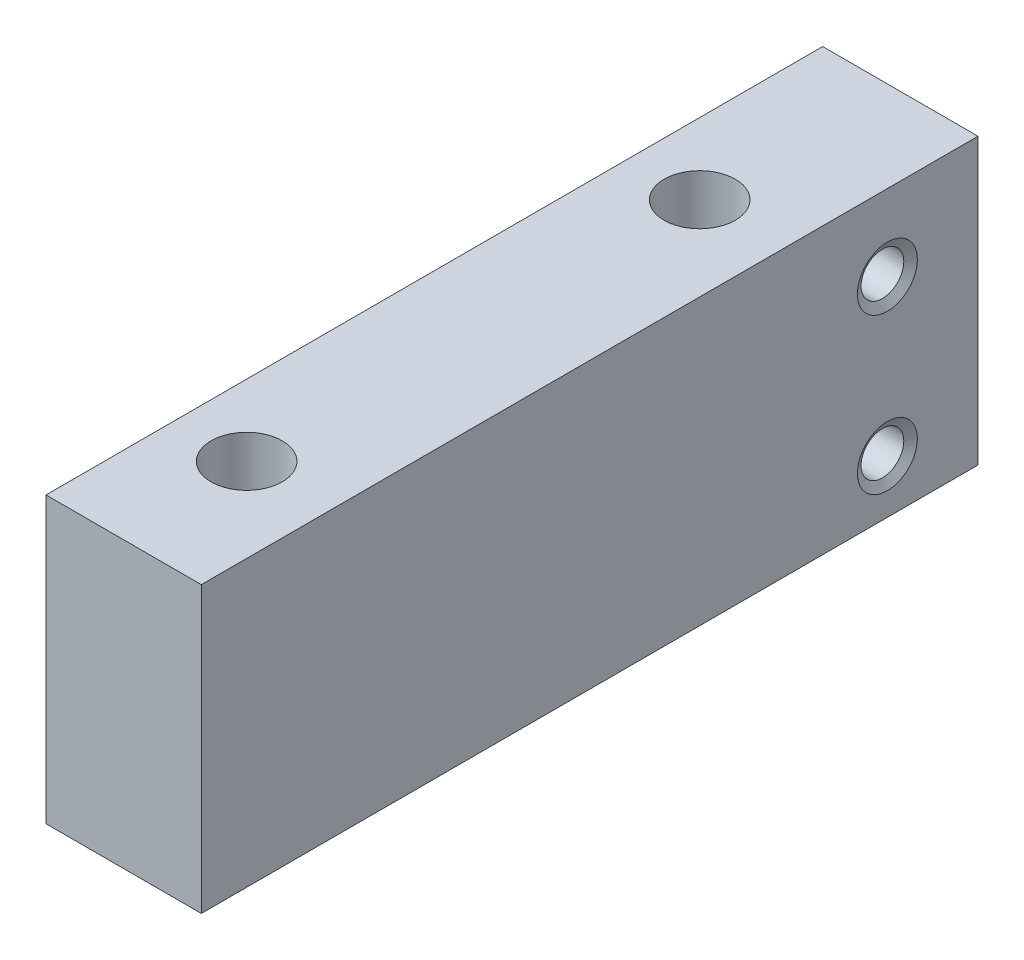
ISO-10303-21;
HEADER;
FILE_DESCRIPTION(('STEP AP214'),'2;1');
FILE_NAME('part.step','',(''),(''),'','','');
FILE_SCHEMA(('AUTOMOTIVE_DESIGN { 1 0 10303 214 1 1 1 1 }'));
ENDSEC;
DATA;
#1=APPLICATION_CONTEXT('core data for automotive mechanical design processes');
#2=APPLICATION_PROTOCOL_DEFINITION('international standard','automotive_design',2000,#1);
#3=PRODUCT_CONTEXT('',#1,'mechanical');
#4=PRODUCT('Part','Part','',(#3));
#5=PRODUCT_RELATED_PRODUCT_CATEGORY('part','',(#4));
#6=PRODUCT_DEFINITION_FORMATION('','',#4);
#7=PRODUCT_DEFINITION_CONTEXT('part definition',#1,'design');
#8=PRODUCT_DEFINITION('design','',#6,#7);
#9=PRODUCT_DEFINITION_SHAPE('','',#8);
#10=(LENGTH_UNIT() NAMED_UNIT(*) SI_UNIT(.MILLI.,.METRE.));
#11=(NAMED_UNIT(*) PLANE_ANGLE_UNIT() SI_UNIT($,.RADIAN.));
#12=(NAMED_UNIT(*) SI_UNIT($,.STERADIAN.) SOLID_ANGLE_UNIT());
#13=UNCERTAINTY_MEASURE_WITH_UNIT(LENGTH_MEASURE(1.E-05),#10,'distance_accuracy_value','');
#14=(GEOMETRIC_REPRESENTATION_CONTEXT(3) GLOBAL_UNCERTAINTY_ASSIGNED_CONTEXT((#13)) GLOBAL_UNIT_ASSIGNED_CONTEXT((#10,
#11,#12)) REPRESENTATION_CONTEXT('',''));
#15=CARTESIAN_POINT('',(0.,0.,0.));
#16=DIRECTION('',(0.,0.,1.));
#17=DIRECTION('',(1.,0.,0.));
#18=AXIS2_PLACEMENT_3D('',#15,#16,#17);
#19=CARTESIAN_POINT('',(6.5,0.,21.));
#20=DIRECTION('',(0.,-1.,0.));
#21=DIRECTION('',(0.,0.,-1.));
#22=AXIS2_PLACEMENT_3D('',#19,#20,#21);
#23=PLANE('',#22);
#24=CARTESIAN_POINT('',(6.5,0.,21.));
#25=DIRECTION('',(0.,-1.,0.));
#26=DIRECTION('',(0.,0.,-1.));
#27=AXIS2_PLACEMENT_3D('',#24,#25,#26);
#28=CIRCLE('',#27,2.75);
#29=CARTESIAN_POINT('',(6.5,0.,18.25));
#30=VERTEX_POINT('',#29);
#31=EDGE_CURVE('E118',#30,#30,#28,.F.);
#32=ORIENTED_EDGE('',*,*,#31,.T.);
#33=EDGE_LOOP('',(#32));
#34=FACE_BOUND('',#33,.T.);
#35=CARTESIAN_POINT('',(6.5,0.,21.));
#36=DIRECTION('',(0.,-1.,0.));
#37=DIRECTION('',(0.,0.,-1.));
#38=AXIS2_PLACEMENT_3D('',#35,#36,#37);
#39=CIRCLE('',#38,4.5);
#40=CARTESIAN_POINT('',(6.5,0.,16.5));
#41=VERTEX_POINT('',#40);
#42=EDGE_CURVE('E120',#41,#41,#39,.T.);
#43=ORIENTED_EDGE('',*,*,#42,.T.);
#44=EDGE_LOOP('',(#43));
#45=FACE_BOUND('',#44,.T.);
#46=ADVANCED_FACE('F16',(#34,#45),#23,.T.);
#47=CARTESIAN_POINT('',(6.5,0.,-13.9999999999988));
#48=DIRECTION('',(0.,-1.,0.));
#49=DIRECTION('',(0.,0.,-1.));
#50=AXIS2_PLACEMENT_3D('',#47,#48,#49);
#51=PLANE('',#50);
#52=CARTESIAN_POINT('',(6.5,0.,-13.9999999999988));
#53=DIRECTION('',(0.,-1.,0.));
#54=DIRECTION('',(0.,0.,-1.));
#55=AXIS2_PLACEMENT_3D('',#52,#53,#54);
#56=CIRCLE('',#55,2.75);
#57=CARTESIAN_POINT('',(6.5,0.,-16.7499999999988));
#58=VERTEX_POINT('',#57);
#59=EDGE_CURVE('E115',#58,#58,#56,.F.);
#60=ORIENTED_EDGE('',*,*,#59,.T.);
#61=EDGE_LOOP('',(#60));
#62=FACE_BOUND('',#61,.T.);
#63=CARTESIAN_POINT('',(6.5,0.,-13.9999999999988));
#64=DIRECTION('',(0.,-1.,0.));
#65=DIRECTION('',(0.,0.,-1.));
#66=AXIS2_PLACEMENT_3D('',#63,#64,#65);
#67=CIRCLE('',#66,4.5);
#68=CARTESIAN_POINT('',(6.5,0.,-18.4999999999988));
#69=VERTEX_POINT('',#68);
#70=EDGE_CURVE('E19',#69,#69,#67,.T.);
#71=ORIENTED_EDGE('',*,*,#70,.T.);
#72=EDGE_LOOP('',(#71));
#73=FACE_BOUND('',#72,.T.);
#74=ADVANCED_FACE('F157',(#62,#73),#51,.T.);
#75=CARTESIAN_POINT('',(12.9999999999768,11.1,-21.9999999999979));
#76=DIRECTION('',(1.,0.,0.));
#77=DIRECTION('',(0.,0.,-1.));
#78=AXIS2_PLACEMENT_3D('',#75,#76,#77);
#79=CONICAL_SURFACE('',#78,2.31499999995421,1.04719755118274);
#80=CARTESIAN_POINT('',(12.9999999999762,11.1,-21.9999999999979));
#81=DIRECTION('',(1.,0.,0.));
#82=DIRECTION('',(0.,0.,-1.));
#83=AXIS2_PLACEMENT_3D('',#80,#81,#82);
#84=CIRCLE('',#83,2.31499999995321);
#85=CARTESIAN_POINT('',(12.9999999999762,11.1,-24.3149999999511));
#86=VERTEX_POINT('',#85);
#87=EDGE_CURVE('E103',#86,#86,#84,.T.);
#88=ORIENTED_EDGE('',*,*,#87,.T.);
#89=EDGE_LOOP('',(#88));
#90=FACE_BOUND('',#89,.T.);
#91=CARTESIAN_POINT('',(12.6160620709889,11.1,-21.9999999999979));
#92=DIRECTION('',(1.,0.,0.));
#93=DIRECTION('',(0.,0.,-1.));
#94=AXIS2_PLACEMENT_3D('',#91,#92,#93);
#95=CIRCLE('',#94,1.65);
#96=CARTESIAN_POINT('',(12.6160620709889,11.1,-23.6499999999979));
#97=VERTEX_POINT('',#96);
#98=EDGE_CURVE('E100',#97,#97,#95,.F.);
#99=ORIENTED_EDGE('',*,*,#98,.T.);
#100=EDGE_LOOP('',(#99));
#101=FACE_BOUND('',#100,.T.);
#102=ADVANCED_FACE('F163',(#90,#101),#79,.F.);
#103=CARTESIAN_POINT('',(12.9999999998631,-0.899999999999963,-21.9999999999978));
#104=DIRECTION('',(1.,0.,0.));
#105=DIRECTION('',(0.,0.,-1.));
#106=AXIS2_PLACEMENT_3D('',#103,#104,#105);
#107=CONICAL_SURFACE('',#106,2.31499999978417,1.04719755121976);
#108=CARTESIAN_POINT('',(12.9999999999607,-0.899999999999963,-21.9999999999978));
#109=DIRECTION('',(1.,0.,0.));
#110=DIRECTION('',(0.,0.,-1.));
#111=AXIS2_PLACEMENT_3D('',#108,#109,#110);
#112=CIRCLE('',#111,2.31499999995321);
#113=CARTESIAN_POINT('',(12.9999999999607,-0.899999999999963,-24.314999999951));
#114=VERTEX_POINT('',#113);
#115=EDGE_CURVE('E112',#114,#114,#112,.T.);
#116=ORIENTED_EDGE('',*,*,#115,.T.);
#117=EDGE_LOOP('',(#116));
#118=FACE_BOUND('',#117,.T.);
#119=CARTESIAN_POINT('',(12.6160620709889,-0.899999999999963,-21.9999999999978));
#120=DIRECTION('',(1.,0.,0.));
#121=DIRECTION('',(0.,0.,-1.));
#122=AXIS2_PLACEMENT_3D('',#119,#120,#121);
#123=CIRCLE('',#122,1.65);
#124=CARTESIAN_POINT('',(12.6160620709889,-0.899999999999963,-23.6499999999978));
#125=VERTEX_POINT('',#124);
#126=EDGE_CURVE('E97',#125,#125,#123,.F.);
#127=ORIENTED_EDGE('',*,*,#126,.T.);
#128=EDGE_LOOP('',(#127));
#129=FACE_BOUND('',#128,.T.);
#130=ADVANCED_FACE('F198',(#118,#129),#107,.F.);
#131=CARTESIAN_POINT('',(6.5,-5.,-13.9999999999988));
#132=DIRECTION('',(0.,-1.,0.));
#133=DIRECTION('',(0.,0.,-1.));
#134=AXIS2_PLACEMENT_3D('',#131,#132,#133);
#135=CYLINDRICAL_SURFACE('',#134,4.5);
#136=ORIENTED_EDGE('',*,*,#70,.F.);
#137=EDGE_LOOP('',(#136));
#138=FACE_BOUND('',#137,.T.);
#139=CARTESIAN_POINT('',(6.5,-5.,-13.9999999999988));
#140=DIRECTION('',(0.,-1.,0.));
#141=DIRECTION('',(0.,0.,-1.));
#142=AXIS2_PLACEMENT_3D('',#139,#140,#141);
#143=CIRCLE('',#142,4.5);
#144=CARTESIAN_POINT('',(6.5,-5.,-18.4999999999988));
#145=VERTEX_POINT('',#144);
#146=EDGE_CURVE('E96',#145,#145,#143,.T.);
#147=ORIENTED_EDGE('',*,*,#146,.T.);
#148=EDGE_LOOP('',(#147));
#149=FACE_BOUND('',#148,.T.);
#150=ADVANCED_FACE('F194',(#138,#149),#135,.F.);
#151=CARTESIAN_POINT('',(6.5,-5.,21.));
#152=DIRECTION('',(0.,-1.,0.));
#153=DIRECTION('',(0.,0.,-1.));
#154=AXIS2_PLACEMENT_3D('',#151,#152,#153);
#155=CYLINDRICAL_SURFACE('',#154,4.5);
#156=ORIENTED_EDGE('',*,*,#42,.F.);
#157=EDGE_LOOP('',(#156));
#158=FACE_BOUND('',#157,.T.);
#159=CARTESIAN_POINT('',(6.5,-5.,21.));
#160=DIRECTION('',(0.,-1.,0.));
#161=DIRECTION('',(0.,0.,-1.));
#162=AXIS2_PLACEMENT_3D('',#159,#160,#161);
#163=CIRCLE('',#162,4.5);
#164=CARTESIAN_POINT('',(6.5,-5.,16.5));
#165=VERTEX_POINT('',#164);
#166=EDGE_CURVE('E94',#165,#165,#163,.T.);
#167=ORIENTED_EDGE('',*,*,#166,.T.);
#168=EDGE_LOOP('',(#167));
#169=FACE_BOUND('',#168,.T.);
#170=ADVANCED_FACE('F152',(#158,#169),#155,.F.);
#171=CARTESIAN_POINT('',(6.5,-5.,21.));
#172=DIRECTION('',(0.,-1.,0.));
#173=DIRECTION('',(0.,0.,-1.));
#174=AXIS2_PLACEMENT_3D('',#171,#172,#173);
#175=CYLINDRICAL_SURFACE('',#174,2.75);
#176=CARTESIAN_POINT('',(6.5,17.,21.));
#177=DIRECTION('',(0.,-1.,0.));
#178=DIRECTION('',(0.,0.,-1.));
#179=AXIS2_PLACEMENT_3D('',#176,#177,#178);
#180=CIRCLE('',#179,2.75);
#181=CARTESIAN_POINT('',(6.5,17.,18.25));
#182=VERTEX_POINT('',#181);
#183=EDGE_CURVE('E81',#182,#182,#180,.F.);
#184=ORIENTED_EDGE('',*,*,#183,.T.);
#185=EDGE_LOOP('',(#184));
#186=FACE_BOUND('',#185,.T.);
#187=ORIENTED_EDGE('',*,*,#31,.F.);
#188=EDGE_LOOP('',(#187));
#189=FACE_BOUND('',#188,.T.);
#190=ADVANCED_FACE('F148',(#186,#189),#175,.F.);
#191=CARTESIAN_POINT('',(6.5,-5.,-13.9999999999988));
#192=DIRECTION('',(0.,-1.,0.));
#193=DIRECTION('',(0.,0.,-1.));
#194=AXIS2_PLACEMENT_3D('',#191,#192,#193);
#195=CYLINDRICAL_SURFACE('',#194,2.75);
#196=CARTESIAN_POINT('',(6.5,17.,-13.9999999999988));
#197=DIRECTION('',(0.,-1.,0.));
#198=DIRECTION('',(0.,0.,-1.));
#199=AXIS2_PLACEMENT_3D('',#196,#197,#198);
#200=CIRCLE('',#199,2.75);
#201=CARTESIAN_POINT('',(6.5,17.,-16.7499999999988));
#202=VERTEX_POINT('',#201);
#203=EDGE_CURVE('E85',#202,#202,#200,.F.);
#204=ORIENTED_EDGE('',*,*,#203,.T.);
#205=EDGE_LOOP('',(#204));
#206=FACE_BOUND('',#205,.T.);
#207=ORIENTED_EDGE('',*,*,#59,.F.);
#208=EDGE_LOOP('',(#207));
#209=FACE_BOUND('',#208,.T.);
#210=ADVANCED_FACE('F151',(#206,#209),#195,.F.);
#211=CARTESIAN_POINT('',(13.,0.,0.));
#212=DIRECTION('',(-1.,0.,0.));
#213=DIRECTION('',(0.,0.,1.));
#214=AXIS2_PLACEMENT_3D('',#211,#212,#213);
#215=PLANE('',#214);
#216=DIRECTION('',(0.,1.,0.));
#217=VECTOR('',#216,1.);
#218=CARTESIAN_POINT('',(13.,15.,31.));
#219=LINE('',#218,#217);
#220=CARTESIAN_POINT('',(13.,17.,31.));
#221=VERTEX_POINT('',#220);
#222=CARTESIAN_POINT('',(13.,-5.,31.));
#223=VERTEX_POINT('',#222);
#224=EDGE_CURVE('E82',#221,#223,#219,.F.);
#225=ORIENTED_EDGE('',*,*,#224,.T.);
#226=DIRECTION('',(0.,0.,1.));
#227=VECTOR('',#226,1.);
#228=CARTESIAN_POINT('',(13.,-5.,-35.));
#229=LINE('',#228,#227);
#230=CARTESIAN_POINT('',(13.,-5.,-28.9999999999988));
#231=VERTEX_POINT('',#230);
#232=EDGE_CURVE('E80',#223,#231,#229,.F.);
#233=ORIENTED_EDGE('',*,*,#232,.T.);
#234=DIRECTION('',(0.,1.,0.));
#235=VECTOR('',#234,1.);
#236=CARTESIAN_POINT('',(13.,15.,-28.9999999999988));
#237=LINE('',#236,#235);
#238=CARTESIAN_POINT('',(13.,17.,-28.9999999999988));
#239=VERTEX_POINT('',#238);
#240=EDGE_CURVE('E52',#231,#239,#237,.T.);
#241=ORIENTED_EDGE('',*,*,#240,.T.);
#242=DIRECTION('',(0.,0.,-1.));
#243=VECTOR('',#242,1.);
#244=CARTESIAN_POINT('',(13.,17.,-35.));
#245=LINE('',#244,#243);
#246=EDGE_CURVE('E41',#239,#221,#245,.F.);
#247=ORIENTED_EDGE('',*,*,#246,.T.);
#248=EDGE_LOOP('',(#225,#233,#241,#247));
#249=FACE_BOUND('',#248,.T.);
#250=ORIENTED_EDGE('',*,*,#87,.F.);
#251=EDGE_LOOP('',(#250));
#252=FACE_BOUND('',#251,.T.);
#253=ORIENTED_EDGE('',*,*,#115,.F.);
#254=EDGE_LOOP('',(#253));
#255=FACE_BOUND('',#254,.T.);
#256=ADVANCED_FACE('F186',(#249,#252,#255),#215,.F.);
#257=CARTESIAN_POINT('',(13.,11.1,-21.9999999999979));
#258=DIRECTION('',(1.,0.,0.));
#259=DIRECTION('',(0.,0.,-1.));
#260=AXIS2_PLACEMENT_3D('',#257,#258,#259);
#261=CYLINDRICAL_SURFACE('',#260,1.65);
#262=CARTESIAN_POINT('',(1.,11.1,-21.9999999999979));
#263=DIRECTION('',(1.,0.,0.));
#264=DIRECTION('',(0.,1.,0.));
#265=AXIS2_PLACEMENT_3D('',#262,#263,#264);
#266=CIRCLE('',#265,1.65);
#267=CARTESIAN_POINT('',(1.,12.75,-21.9999999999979));
#268=VERTEX_POINT('',#267);
#269=EDGE_CURVE('E125',#268,#268,#266,.F.);
#270=ORIENTED_EDGE('',*,*,#269,.T.);
#271=EDGE_LOOP('',(#270));
#272=FACE_BOUND('',#271,.T.);
#273=ORIENTED_EDGE('',*,*,#98,.F.);
#274=EDGE_LOOP('',(#273));
#275=FACE_BOUND('',#274,.T.);
#276=ADVANCED_FACE('F182',(#272,#275),#261,.F.);
#277=CARTESIAN_POINT('',(13.,-0.899999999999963,-21.9999999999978));
#278=DIRECTION('',(1.,0.,0.));
#279=DIRECTION('',(0.,0.,-1.));
#280=AXIS2_PLACEMENT_3D('',#277,#278,#279);
#281=CYLINDRICAL_SURFACE('',#280,1.65);
#282=CARTESIAN_POINT('',(1.,-0.899999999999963,-21.9999999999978));
#283=DIRECTION('',(1.,0.,0.));
#284=DIRECTION('',(0.,1.,0.));
#285=AXIS2_PLACEMENT_3D('',#282,#283,#284);
#286=CIRCLE('',#285,1.65);
#287=CARTESIAN_POINT('',(1.,0.750000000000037,-21.9999999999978));
#288=VERTEX_POINT('',#287);
#289=EDGE_CURVE('E129',#288,#288,#286,.F.);
#290=ORIENTED_EDGE('',*,*,#289,.T.);
#291=EDGE_LOOP('',(#290));
#292=FACE_BOUND('',#291,.T.);
#293=ORIENTED_EDGE('',*,*,#126,.F.);
#294=EDGE_LOOP('',(#293));
#295=FACE_BOUND('',#294,.T.);
#296=ADVANCED_FACE('F179',(#292,#295),#281,.F.);
#297=CARTESIAN_POINT('',(13.,15.,-28.9999999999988));
#298=DIRECTION('',(0.,0.,1.));
#299=DIRECTION('',(1.,0.,0.));
#300=AXIS2_PLACEMENT_3D('',#297,#298,#299);
#301=PLANE('',#300);
#302=DIRECTION('',(1.,0.,0.));
#303=VECTOR('',#302,1.);
#304=CARTESIAN_POINT('',(13.,-5.,-28.9999999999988));
#305=LINE('',#304,#303);
#306=CARTESIAN_POINT('',(1.,-5.,-28.9999999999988));
#307=VERTEX_POINT('',#306);
#308=EDGE_CURVE('E92',#231,#307,#305,.F.);
#309=ORIENTED_EDGE('',*,*,#308,.T.);
#310=DIRECTION('',(0.,1.,0.));
#311=VECTOR('',#310,1.);
#312=CARTESIAN_POINT('',(1.,17.,-28.9999999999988));
#313=LINE('',#312,#311);
#314=CARTESIAN_POINT('',(1.,17.,-28.9999999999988));
#315=VERTEX_POINT('',#314);
#316=EDGE_CURVE('E65',#307,#315,#313,.T.);
#317=ORIENTED_EDGE('',*,*,#316,.T.);
#318=DIRECTION('',(1.,0.,0.));
#319=VECTOR('',#318,1.);
#320=CARTESIAN_POINT('',(13.,17.,-28.9999999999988));
#321=LINE('',#320,#319);
#322=EDGE_CURVE('E11',#315,#239,#321,.T.);
#323=ORIENTED_EDGE('',*,*,#322,.T.);
#324=ORIENTED_EDGE('',*,*,#240,.F.);
#325=EDGE_LOOP('',(#309,#317,#323,#324));
#326=FACE_BOUND('',#325,.T.);
#327=ADVANCED_FACE('F138',(#326),#301,.F.);
#328=CARTESIAN_POINT('',(13.,-5.,-35.));
#329=DIRECTION('',(0.,1.,0.));
#330=DIRECTION('',(0.,0.,1.));
#331=AXIS2_PLACEMENT_3D('',#328,#329,#330);
#332=PLANE('',#331);
#333=DIRECTION('',(1.,0.,0.));
#334=VECTOR('',#333,1.);
#335=CARTESIAN_POINT('',(13.,-5.,31.));
#336=LINE('',#335,#334);
#337=CARTESIAN_POINT('',(1.,-5.,31.));
#338=VERTEX_POINT('',#337);
#339=EDGE_CURVE('E74',#223,#338,#336,.F.);
#340=ORIENTED_EDGE('',*,*,#339,.T.);
#341=DIRECTION('',(0.,0.,1.));
#342=VECTOR('',#341,1.);
#343=CARTESIAN_POINT('',(1.,-5.,-28.9999999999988));
#344=LINE('',#343,#342);
#345=EDGE_CURVE('E62',#307,#338,#344,.T.);
#346=ORIENTED_EDGE('',*,*,#345,.F.);
#347=ORIENTED_EDGE('',*,*,#308,.F.);
#348=ORIENTED_EDGE('',*,*,#232,.F.);
#349=EDGE_LOOP('',(#340,#346,#347,#348));
#350=FACE_BOUND('',#349,.T.);
#351=ORIENTED_EDGE('',*,*,#166,.F.);
#352=EDGE_LOOP('',(#351));
#353=FACE_BOUND('',#352,.T.);
#354=ORIENTED_EDGE('',*,*,#146,.F.);
#355=EDGE_LOOP('',(#354));
#356=FACE_BOUND('',#355,.T.);
#357=ADVANCED_FACE('F78',(#350,#353,#356),#332,.F.);
#358=CARTESIAN_POINT('',(13.,15.,31.));
#359=DIRECTION('',(0.,0.,-1.));
#360=DIRECTION('',(0.,1.,0.));
#361=AXIS2_PLACEMENT_3D('',#358,#359,#360);
#362=PLANE('',#361);
#363=DIRECTION('',(1.,0.,0.));
#364=VECTOR('',#363,1.);
#365=CARTESIAN_POINT('',(13.,17.,31.));
#366=LINE('',#365,#364);
#367=CARTESIAN_POINT('',(1.,17.,31.));
#368=VERTEX_POINT('',#367);
#369=EDGE_CURVE('E24',#221,#368,#366,.F.);
#370=ORIENTED_EDGE('',*,*,#369,.T.);
#371=DIRECTION('',(0.,1.,0.));
#372=VECTOR('',#371,1.);
#373=CARTESIAN_POINT('',(1.,17.,31.));
#374=LINE('',#373,#372);
#375=EDGE_CURVE('E32',#338,#368,#374,.T.);
#376=ORIENTED_EDGE('',*,*,#375,.F.);
#377=ORIENTED_EDGE('',*,*,#339,.F.);
#378=ORIENTED_EDGE('',*,*,#224,.F.);
#379=EDGE_LOOP('',(#370,#376,#377,#378));
#380=FACE_BOUND('',#379,.T.);
#381=ADVANCED_FACE('F73',(#380),#362,.F.);
#382=CARTESIAN_POINT('',(13.,17.,-35.));
#383=DIRECTION('',(0.,-1.,0.));
#384=DIRECTION('',(0.,0.,-1.));
#385=AXIS2_PLACEMENT_3D('',#382,#383,#384);
#386=PLANE('',#385);
#387=ORIENTED_EDGE('',*,*,#322,.F.);
#388=DIRECTION('',(0.,0.,1.));
#389=VECTOR('',#388,1.);
#390=CARTESIAN_POINT('',(1.,17.,-28.9999999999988));
#391=LINE('',#390,#389);
#392=EDGE_CURVE('E57',#315,#368,#391,.T.);
#393=ORIENTED_EDGE('',*,*,#392,.T.);
#394=ORIENTED_EDGE('',*,*,#369,.F.);
#395=ORIENTED_EDGE('',*,*,#246,.F.);
#396=EDGE_LOOP('',(#387,#393,#394,#395));
#397=FACE_BOUND('',#396,.T.);
#398=ORIENTED_EDGE('',*,*,#203,.F.);
#399=EDGE_LOOP('',(#398));
#400=FACE_BOUND('',#399,.T.);
#401=ORIENTED_EDGE('',*,*,#183,.F.);
#402=EDGE_LOOP('',(#401));
#403=FACE_BOUND('',#402,.T.);
#404=ADVANCED_FACE('F140',(#397,#400,#403),#386,.F.);
#405=CARTESIAN_POINT('',(1.,17.,-28.9999999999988));
#406=DIRECTION('',(1.,0.,0.));
#407=DIRECTION('',(0.,1.,0.));
#408=AXIS2_PLACEMENT_3D('',#405,#406,#407);
#409=PLANE('',#408);
#410=ORIENTED_EDGE('',*,*,#289,.F.);
#411=EDGE_LOOP('',(#410));
#412=FACE_BOUND('',#411,.T.);
#413=ORIENTED_EDGE('',*,*,#375,.T.);
#414=ORIENTED_EDGE('',*,*,#392,.F.);
#415=ORIENTED_EDGE('',*,*,#316,.F.);
#416=ORIENTED_EDGE('',*,*,#345,.T.);
#417=EDGE_LOOP('',(#413,#414,#415,#416));
#418=FACE_BOUND('',#417,.T.);
#419=ORIENTED_EDGE('',*,*,#269,.F.);
#420=EDGE_LOOP('',(#419));
#421=FACE_BOUND('',#420,.T.);
#422=ADVANCED_FACE('F63',(#412,#418,#421),#409,.F.);
#423=CLOSED_SHELL('',(#46,#74,#102,#130,#150,#170,#190,#210,#256,#276,#296,#327,#357,#381,#404,#422));
#424=MANIFOLD_SOLID_BREP('B1',#423);
#425=ADVANCED_BREP_SHAPE_REPRESENTATION('',(#18,#424),#14);
#426=SHAPE_DEFINITION_REPRESENTATION(#9,#425);
ENDSEC;
END-ISO-10303-21;
